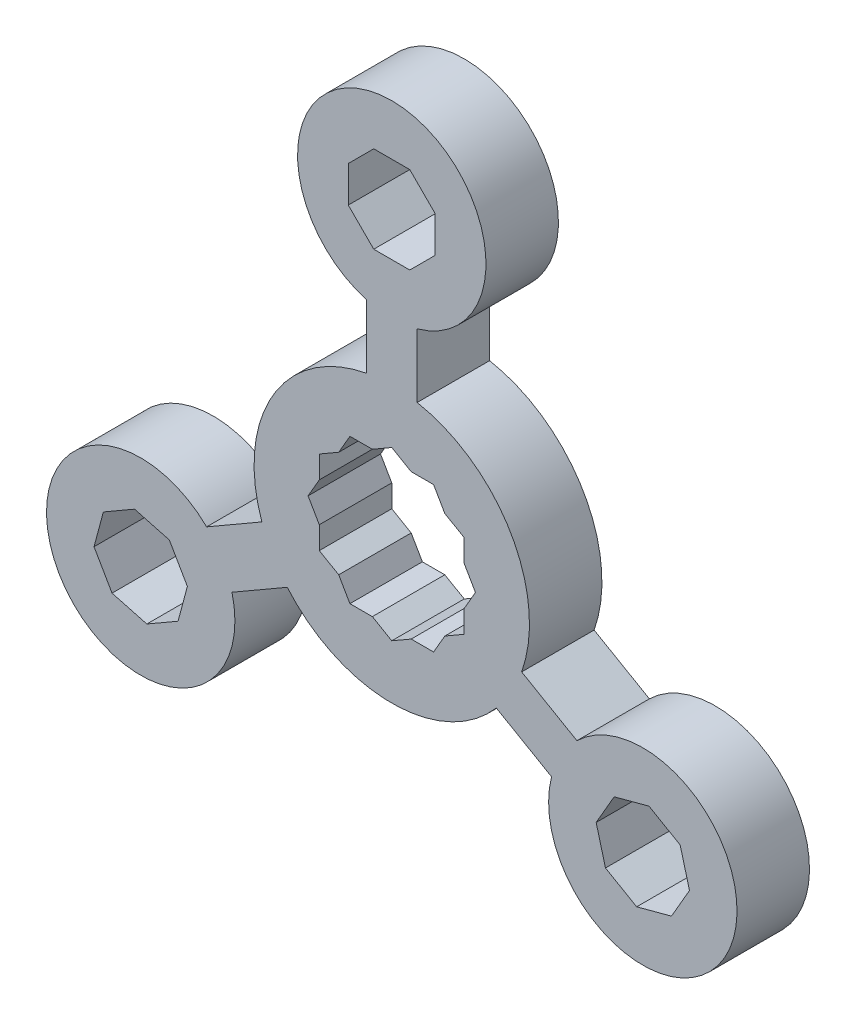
from build123d import *

# Parameters (mm, degrees)
SALIENTE_EXTRUIR1_DEPTH = 10


with BuildPart() as part:
    # Croquis1 → Saliente-Extruir1 (new body)
    with BuildSketch(Plane.XY):
        with BuildLine():
            ThreePointArc((3.5, 27.480015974), (0, 53), (-3.5, 27.480015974))
            Line((-3.5, 27.480015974), (-3.5, 18.674849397))
            ThreePointArc((-3.5, 18.674849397), (-16.454482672, 9.5), (-17.92289399, -6.306335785))
            Line((-17.92289399, -6.306335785), (-25.54839193, -10.708919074))
            ThreePointArc((-25.54839193, -10.708919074), (-45.899346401, -26.5), (-22.04839193, -16.7710969))
            Line((-22.04839193, -16.7710969), (-14.42289399, -12.368513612))
            ThreePointArc((-14.42289399, -12.368513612), (0, -19), (14.42289399, -12.368513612))
            Line((14.42289399, -12.368513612), (22.04839193, -16.7710969))
            ThreePointArc((22.04839193, -16.7710969), (45.899346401, -26.5), (25.54839193, -10.708919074))
            Line((25.54839193, -10.708919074), (17.92289399, -6.306335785))
            ThreePointArc((17.92289399, -6.306335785), (16.454482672, 9.5), (3.5, 18.674849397))
            Line((3.5, 18.674849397), (3.5, 27.480015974))
        make_face()
        Polygon((-30.687504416, -14.847683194), (-28.202223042, -19.152316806), (-29.488699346, -23.953511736), (-33.793332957, -26.43879311), (-38.594527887, -25.152316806), (-41.079809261, -20.847683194), (-39.793332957, -16.046488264), (-35.488699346, -13.56120689), align=None, mode=Mode.SUBTRACT)
        Polygon((30.687504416, -14.847683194), (35.488699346, -13.56120689), (39.793332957, -16.046488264), (41.079809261, -20.847683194), (38.594527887, -25.152316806), (33.793332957, -26.43879311), (29.488699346, -23.953511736), (28.202223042, -19.152316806), align=None, mode=Mode.SUBTRACT)
        Polygon((7.320508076, 7.320508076), (10, 5.773502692), (10, 2.679491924), (11.547005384, 0), (10, -2.679491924), (10, -5.773502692), (7.320508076, -7.320508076), (5.773502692, -10), (2.679491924, -10), (0, -11.547005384), (-2.679491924, -10), (-5.773502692, -10), (-7.320508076, -7.320508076), (-10, -5.773502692), (-10, -2.679491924), (-11.547005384, 0), (-10, 2.679491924), (-10, 5.773502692), (-7.320508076, 7.320508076), (-5.773502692, 10), (-2.679491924, 10), (0, 11.547005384), (2.679491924, 10), (5.773502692, 10), align=None, mode=Mode.SUBTRACT)
        Polygon((-2.485281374, 46), (2.485281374, 46), (6, 42.485281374), (6, 37.514718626), (2.485281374, 34), (-2.485281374, 34), (-6, 37.514718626), (-6, 42.485281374), align=None, mode=Mode.SUBTRACT)
    extrude(amount=SALIENTE_EXTRUIR1_DEPTH)


solid = part.part
